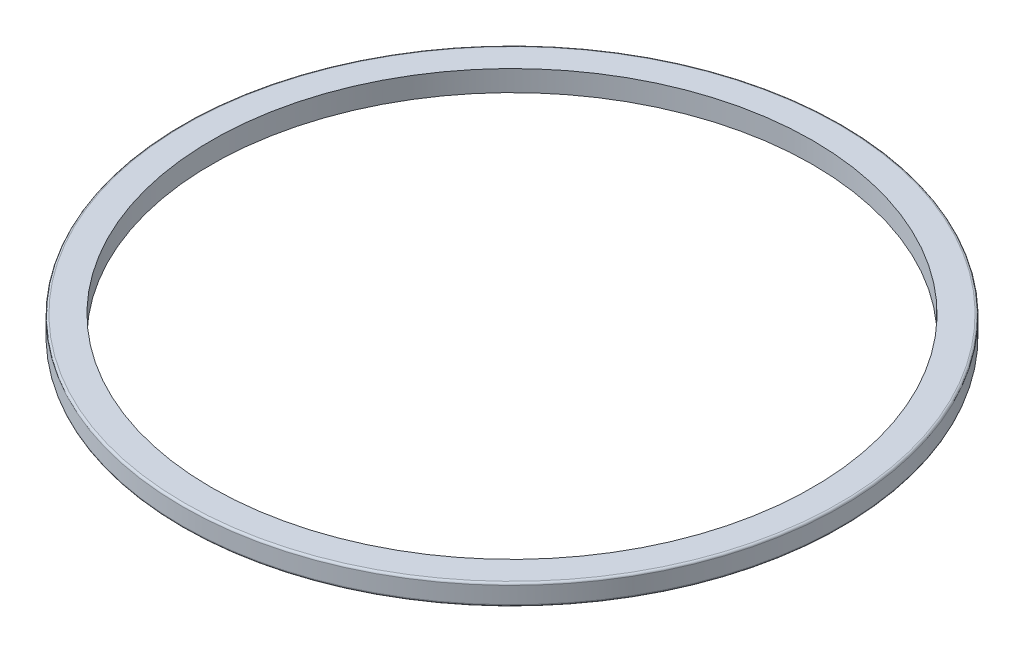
from build123d import *

# Parameters (mm, degrees)
SKETCH1_R           = 100.33
SKETCH1_R_2         = 91.51112
BOSS_EXTRUDE1_DEPTH = 6.35
FILLET1_R           = 0.635


with BuildPart() as part:
    # Sketch1 → Boss-Extrude1 (new body)
    with BuildSketch(Plane(origin=(0, 0, 0), x_dir=(1, 0, 0), z_dir=(0, 1, 0))):
        with Locations(Location((0, 0, 0), (0, 0, 270))):
            Circle(SKETCH1_R)
        with Locations(Location((0, 0, 0), (0, 0, 270))):
            Circle(SKETCH1_R_2, mode=Mode.SUBTRACT)
    extrude(amount=BOSS_EXTRUDE1_DEPTH)

    # Fillet1
    fillet1_edges = [part.edges().sort_by_distance(p)[0] for p in [
        (0, 0, -100.33),
        (0, 6.35, -100.33),
    ]]
    fillet(fillet1_edges, radius=FILLET1_R)


solid = part.part
